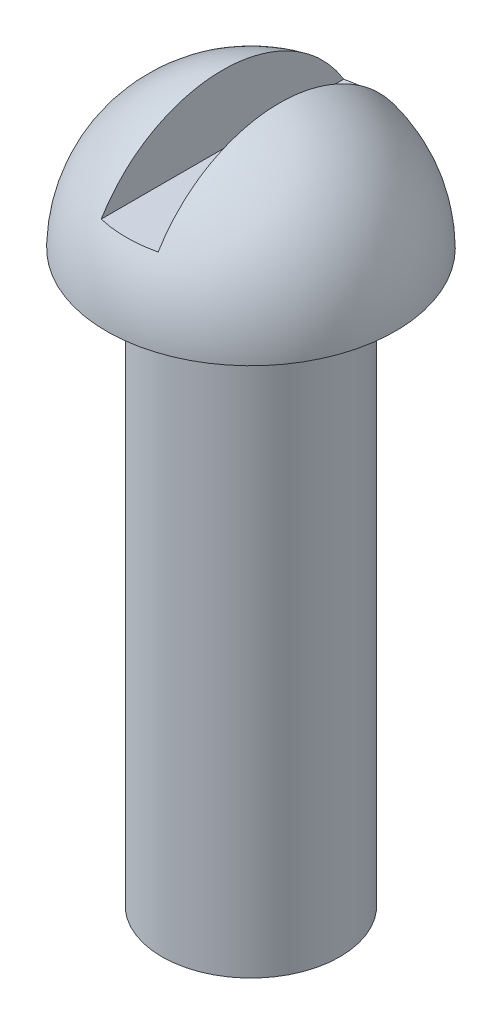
ISO-10303-21;
HEADER;
FILE_DESCRIPTION(('STEP AP214'),'2;1');
FILE_NAME('part.step','',(''),(''),'','','');
FILE_SCHEMA(('AUTOMOTIVE_DESIGN { 1 0 10303 214 1 1 1 1 }'));
ENDSEC;
DATA;
#1=APPLICATION_CONTEXT('core data for automotive mechanical design processes');
#2=APPLICATION_PROTOCOL_DEFINITION('international standard','automotive_design',2000,#1);
#3=PRODUCT_CONTEXT('',#1,'mechanical');
#4=PRODUCT('Part','Part','',(#3));
#5=PRODUCT_RELATED_PRODUCT_CATEGORY('part','',(#4));
#6=PRODUCT_DEFINITION_FORMATION('','',#4);
#7=PRODUCT_DEFINITION_CONTEXT('part definition',#1,'design');
#8=PRODUCT_DEFINITION('design','',#6,#7);
#9=PRODUCT_DEFINITION_SHAPE('','',#8);
#10=(LENGTH_UNIT() NAMED_UNIT(*) SI_UNIT(.MILLI.,.METRE.));
#11=(NAMED_UNIT(*) PLANE_ANGLE_UNIT() SI_UNIT($,.RADIAN.));
#12=(NAMED_UNIT(*) SI_UNIT($,.STERADIAN.) SOLID_ANGLE_UNIT());
#13=UNCERTAINTY_MEASURE_WITH_UNIT(LENGTH_MEASURE(1.E-05),#10,'distance_accuracy_value','');
#14=(GEOMETRIC_REPRESENTATION_CONTEXT(3) GLOBAL_UNCERTAINTY_ASSIGNED_CONTEXT((#13)) GLOBAL_UNIT_ASSIGNED_CONTEXT((#10,
#11,#12)) REPRESENTATION_CONTEXT('',''));
#15=CARTESIAN_POINT('',(0.,0.,0.));
#16=DIRECTION('',(0.,0.,1.));
#17=DIRECTION('',(1.,0.,0.));
#18=AXIS2_PLACEMENT_3D('',#15,#16,#17);
#19=CARTESIAN_POINT('',(0.,-0.0767715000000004,0.));
#20=DIRECTION('',(0.,1.,0.));
#21=DIRECTION('',(1.,0.,0.));
#22=AXIS2_PLACEMENT_3D('',#19,#20,#21);
#23=SPHERICAL_SURFACE('',#22,5.1567715);
#24=CARTESIAN_POINT('',(0.,2.54,0.));
#25=DIRECTION('',(0.,1.,0.));
#26=DIRECTION('',(-1.,0.,0.));
#27=AXIS2_PLACEMENT_3D('',#24,#25,#26);
#28=CIRCLE('',#27,4.44351203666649);
#29=CARTESIAN_POINT('',(-1.016,2.54,-4.32579972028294));
#30=VERTEX_POINT('',#29);
#31=CARTESIAN_POINT('',(1.016,2.54,-4.32579972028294));
#32=VERTEX_POINT('',#31);
#33=EDGE_CURVE('E38',#30,#32,#28,.F.);
#34=ORIENTED_EDGE('',*,*,#33,.T.);
#35=CARTESIAN_POINT('',(1.016,-0.0767715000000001,0.));
#36=DIRECTION('',(1.,0.,0.));
#37=DIRECTION('',(0.,1.,0.));
#38=AXIS2_PLACEMENT_3D('',#35,#36,#37);
#39=CIRCLE('',#38,5.05569345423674);
#40=CARTESIAN_POINT('',(1.016,2.54,4.32579972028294));
#41=VERTEX_POINT('',#40);
#42=EDGE_CURVE('E11',#41,#32,#39,.F.);
#43=ORIENTED_EDGE('',*,*,#42,.F.);
#44=CARTESIAN_POINT('',(-1.016,2.54,4.32579972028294));
#45=VERTEX_POINT('',#44);
#46=EDGE_CURVE('E45',#41,#45,#28,.F.);
#47=ORIENTED_EDGE('',*,*,#46,.T.);
#48=CARTESIAN_POINT('',(-1.016,-0.0767714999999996,0.));
#49=DIRECTION('',(-1.,0.,0.));
#50=DIRECTION('',(0.,-1.,0.));
#51=AXIS2_PLACEMENT_3D('',#48,#49,#50);
#52=CIRCLE('',#51,5.05569345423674);
#53=EDGE_CURVE('E57',#30,#45,#52,.F.);
#54=ORIENTED_EDGE('',*,*,#53,.F.);
#55=EDGE_LOOP('',(#34,#43,#47,#54));
#56=FACE_BOUND('',#55,.T.);
#57=CARTESIAN_POINT('',(0.,0.,0.));
#58=DIRECTION('',(0.,1.,0.));
#59=DIRECTION('',(-1.,0.,0.));
#60=AXIS2_PLACEMENT_3D('',#57,#58,#59);
#61=CIRCLE('',#60,5.1562);
#62=CARTESIAN_POINT('',(-5.1562,0.,0.));
#63=VERTEX_POINT('',#62);
#64=EDGE_CURVE('E62',#63,#63,#61,.T.);
#65=ORIENTED_EDGE('',*,*,#64,.T.);
#66=EDGE_LOOP('',(#65));
#67=FACE_BOUND('',#66,.T.);
#68=ADVANCED_FACE('F31',(#56,#67),#23,.T.);
#69=CARTESIAN_POINT('',(5.1562,0.,0.));
#70=DIRECTION('',(0.,-1.,0.));
#71=DIRECTION('',(1.,0.,0.));
#72=AXIS2_PLACEMENT_3D('',#69,#70,#71);
#73=PLANE('',#72);
#74=CARTESIAN_POINT('',(0.,0.,0.));
#75=DIRECTION('',(0.,1.,0.));
#76=DIRECTION('',(-1.,0.,0.));
#77=AXIS2_PLACEMENT_3D('',#74,#75,#76);
#78=CIRCLE('',#77,3.175);
#79=CARTESIAN_POINT('',(-3.175,0.,0.));
#80=VERTEX_POINT('',#79);
#81=EDGE_CURVE('E74',#80,#80,#78,.T.);
#82=ORIENTED_EDGE('',*,*,#81,.T.);
#83=EDGE_LOOP('',(#82));
#84=FACE_BOUND('',#83,.T.);
#85=ORIENTED_EDGE('',*,*,#64,.F.);
#86=EDGE_LOOP('',(#85));
#87=FACE_BOUND('',#86,.T.);
#88=ADVANCED_FACE('F80',(#84,#87),#73,.T.);
#89=CARTESIAN_POINT('',(0.,10.1105238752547,0.));
#90=DIRECTION('',(0.,1.,0.));
#91=DIRECTION('',(-1.,0.,0.));
#92=AXIS2_PLACEMENT_3D('',#89,#90,#91);
#93=CYLINDRICAL_SURFACE('',#92,3.175);
#94=CARTESIAN_POINT('',(0.,-20.32,0.));
#95=DIRECTION('',(0.,1.,0.));
#96=DIRECTION('',(-1.,0.,0.));
#97=AXIS2_PLACEMENT_3D('',#94,#95,#96);
#98=CIRCLE('',#97,3.175);
#99=CARTESIAN_POINT('',(-3.175,-20.32,0.));
#100=VERTEX_POINT('',#99);
#101=EDGE_CURVE('E69',#100,#100,#98,.T.);
#102=ORIENTED_EDGE('',*,*,#101,.T.);
#103=EDGE_LOOP('',(#102));
#104=FACE_BOUND('',#103,.T.);
#105=ORIENTED_EDGE('',*,*,#81,.F.);
#106=EDGE_LOOP('',(#105));
#107=FACE_BOUND('',#106,.T.);
#108=ADVANCED_FACE('F82',(#104,#107),#93,.T.);
#109=CARTESIAN_POINT('',(3.175,-20.32,0.));
#110=DIRECTION('',(0.,-1.,0.));
#111=DIRECTION('',(1.,0.,0.));
#112=AXIS2_PLACEMENT_3D('',#109,#110,#111);
#113=PLANE('',#112);
#114=ORIENTED_EDGE('',*,*,#101,.F.);
#115=EDGE_LOOP('',(#114));
#116=FACE_BOUND('',#115,.T.);
#117=ADVANCED_FACE('F88',(#116),#113,.T.);
#118=CARTESIAN_POINT('',(1.016,2.54,-5.1562));
#119=DIRECTION('',(1.,0.,0.));
#120=DIRECTION('',(0.,1.,0.));
#121=AXIS2_PLACEMENT_3D('',#118,#119,#120);
#122=PLANE('',#121);
#123=ORIENTED_EDGE('',*,*,#42,.T.);
#124=DIRECTION('',(0.,0.,1.));
#125=VECTOR('',#124,1.);
#126=CARTESIAN_POINT('',(1.016,2.54,-5.1562));
#127=LINE('',#126,#125);
#128=EDGE_CURVE('E66',#32,#41,#127,.T.);
#129=ORIENTED_EDGE('',*,*,#128,.T.);
#130=EDGE_LOOP('',(#123,#129));
#131=FACE_BOUND('',#130,.T.);
#132=ADVANCED_FACE('F94',(#131),#122,.F.);
#133=CARTESIAN_POINT('',(1.016,2.54,-5.1562));
#134=DIRECTION('',(0.,1.,0.));
#135=DIRECTION('',(-1.,0.,0.));
#136=AXIS2_PLACEMENT_3D('',#133,#134,#135);
#137=PLANE('',#136);
#138=DIRECTION('',(0.,0.,1.));
#139=VECTOR('',#138,1.);
#140=CARTESIAN_POINT('',(-1.016,2.54,-5.1562));
#141=LINE('',#140,#139);
#142=EDGE_CURVE('E65',#30,#45,#141,.T.);
#143=ORIENTED_EDGE('',*,*,#142,.T.);
#144=ORIENTED_EDGE('',*,*,#46,.F.);
#145=ORIENTED_EDGE('',*,*,#128,.F.);
#146=ORIENTED_EDGE('',*,*,#33,.F.);
#147=EDGE_LOOP('',(#143,#144,#145,#146));
#148=FACE_BOUND('',#147,.T.);
#149=ADVANCED_FACE('F64',(#148),#137,.T.);
#150=CARTESIAN_POINT('',(-1.016,4.97892195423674,-5.1562));
#151=DIRECTION('',(-1.,0.,0.));
#152=DIRECTION('',(0.,-1.,0.));
#153=AXIS2_PLACEMENT_3D('',#150,#151,#152);
#154=PLANE('',#153);
#155=ORIENTED_EDGE('',*,*,#142,.F.);
#156=ORIENTED_EDGE('',*,*,#53,.T.);
#157=EDGE_LOOP('',(#155,#156));
#158=FACE_BOUND('',#157,.T.);
#159=ADVANCED_FACE('F67',(#158),#154,.F.);
#160=CLOSED_SHELL('',(#68,#88,#108,#117,#132,#149,#159));
#161=MANIFOLD_SOLID_BREP('B2',#160);
#162=ADVANCED_BREP_SHAPE_REPRESENTATION('',(#18,#161),#14);
#163=SHAPE_DEFINITION_REPRESENTATION(#9,#162);
ENDSEC;
END-ISO-10303-21;
